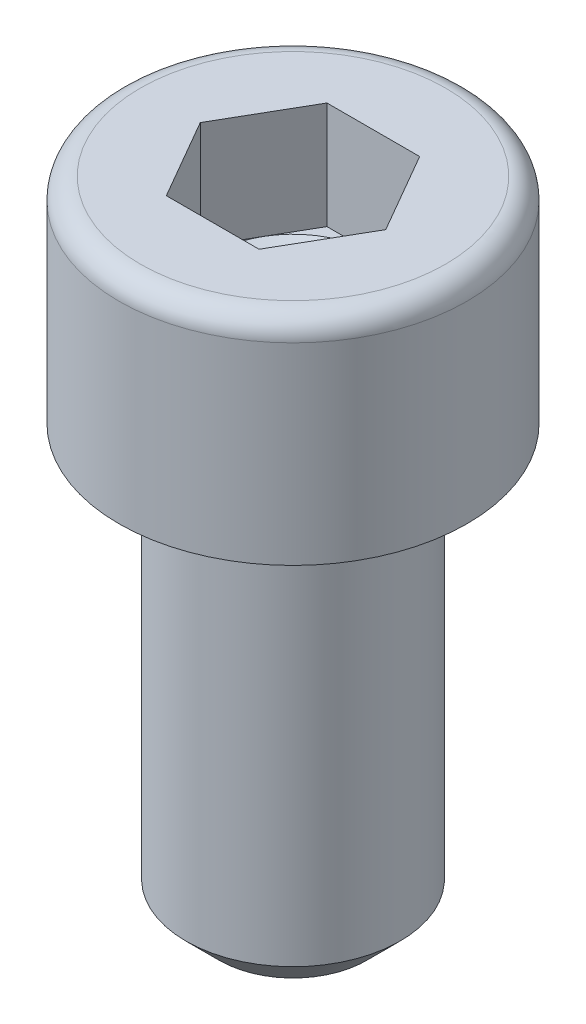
from build123d import *

# Parameters (mm, degrees)
TIGE_START              = -16
ESQUISSE1_R             = 4
TIGE_DEPTH              = 16
CHANFREIN_D_ENTR_E_SIZE = 1.25
HEXAGONE_DEPTH          = 4


with BuildPart() as part:
    # Esquisse1 → Tige (new body)
    with BuildSketch(Plane(origin=(0, 0, 0), x_dir=(1, 0, 0), z_dir=(0, 1, 0)).offset(TIGE_START)):
        with Locations(Location((0, 0, 0), (0, 0, 270))):
            Circle(ESQUISSE1_R)
    extrude(amount=TIGE_DEPTH)

    # Chanfrein d_entr_e
    chanfrein_d_entr_e_edges = [part.edges().sort_by_distance(p)[0] for p in [
        (0, -16, -4),
    ]]
    chamfer(chanfrein_d_entr_e_edges, length=CHANFREIN_D_ENTR_E_SIZE)

    # Esquisse2 → T_te (revolve)
    with BuildSketch(Plane.XY, mode=Mode.PRIVATE) as t_te_sk:
        with BuildLine():
            Line((3, 8), (3, 4))
            Line((3, 4), (0, 2.267949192))
            Line((0, 2.267949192), (0, 0))
            Line((0, 0), (6.5, 0))
            Line((6.5, 0), (6.5, 7.2))
            ThreePointArc((6.5, 7.2), (6.265685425, 7.765685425), (5.7, 8))
            Line((5.7, 8), (3, 8))
        make_face()
    revolve(t_te_sk.sketch.rotate(Axis((0, 8, 0), (0, -1, 0)), 180), axis=Axis((0, 8, 0), (0, -1, 0)))

    # Esquisse3 → Hexagone (cut)
    with BuildSketch(Plane(origin=(0, 8, -3), x_dir=(1, 0, 0), z_dir=(0, -1, 0))):
        Polygon((1.732050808, 6), (-1.732050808, 6), (-3.464101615, 3), (-1.732050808, 0), (1.732050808, 0), (3.464101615, 3), align=None)
    extrude(amount=HEXAGONE_DEPTH, mode=Mode.SUBTRACT)


solid = part.part
